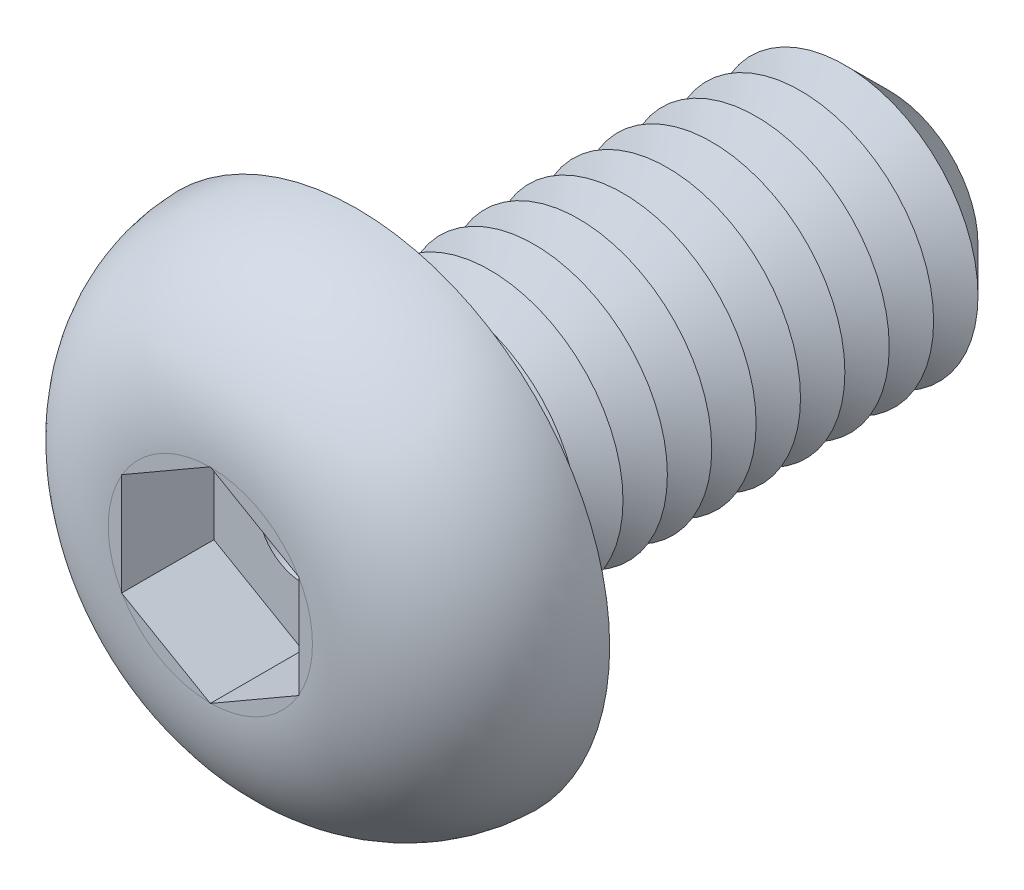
from build123d import *

# Parameters (mm, degrees)
CUT_EXTRUDE1_DEPTH  = 1.04
SKETCH4_R           = 1.5
BOSS_EXTRUDE1_DEPTH = 6
CHAMFER1_SIZE       = 0.5
LPATTERN1_COUNT     = 10
LPATTERN1_PITCH     = 0.5
FILLET2_R           = 0.25
SKETCH6_R           = 0.5
CUT_EXTRUDE2_DEPTH  = 6.61


with BuildPart() as part:
    # Sketch2 → Revolve1 (revolve)
    with BuildSketch(Plane(origin=(0, 0, 0), x_dir=(0, 0, -1), z_dir=(1, 0, 0)), mode=Mode.PRIVATE) as revolve1_sk:
        with BuildLine():
            Line((0, 0), (-1.65, 0))
            Line((-1.65, 0), (-1.65, 1.150735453))
            ThreePointArc((-1.65, 1.150735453), (-1.169631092, 2.335007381), (0, 2.85))
            Line((0, 2.85), (0, 0))
        make_face()
    revolve(revolve1_sk.sketch.rotate(Axis((0, 0, 47.934239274), (0, 0, -1)), 90), axis=Axis((0, 0, 47.934239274), (0, 0, -1)))

    # Sketch3 → Cut-Extrude1 (cut)
    with BuildSketch(Plane.XY.offset(1.65)):
        Polygon((0, 1.154700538), (-1, 0.577350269), (-1, -0.577350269), (0, -1.154700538), (1, -0.577350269), (1, 0.577350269), align=None)
    extrude(amount=-CUT_EXTRUDE1_DEPTH, mode=Mode.SUBTRACT)


with BuildPart() as cut_extrude1_kept_piece:
    # of the separate pieces the step leaves, the one the design keeps (cut_extrude1_pieces_kept)
    add(part.part.solids().sort_by_distance((2.85, 0, 0))[0])

    # Sketch4 → Boss-Extrude1 (add)
    with BuildSketch(Plane(origin=(0, 0, 0), x_dir=(-1, 0, 0), z_dir=(0, 0, -1))):
        with Locations(Location((0, 0, 0), (0, 0, 180))):
            Circle(SKETCH4_R)
    extrude(amount=BOSS_EXTRUDE1_DEPTH)

    # Chamfer1
    chamfer1_edges = [cut_extrude1_kept_piece.edges().sort_by_distance(p)[0] for p in [
        (-1.5, 0, -6),
    ]]
    chamfer(chamfer1_edges, length=CHAMFER1_SIZE)

    # Sketch5 → Cut-Revolve1 (revolve, cut)
    with BuildSketch(Plane(origin=(0, 0, 0), x_dir=(0, 0, -1), z_dir=(1, 0, 0)), mode=Mode.PRIVATE) as cut_revolve1_sk:
        Polygon((0.5, 1.5), (1, 1.5), (0.75, 1.066987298), align=None)
    cut_revolve1 = revolve(cut_revolve1_sk.sketch.rotate(Axis((0, 0, 47.934239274), (0, 0, -1)), 90), axis=Axis((0, 0, 47.934239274), (0, 0, -1)), mode=Mode.SUBTRACT)

    # LPattern1: Cut-Revolve1 ×10
    with Locations(*[(0, 0, -i * LPATTERN1_PITCH) for i in range(1, LPATTERN1_COUNT)]):
        add(cut_revolve1, mode=Mode.SUBTRACT)

    # Fillet2
    fillet2_edges = [cut_extrude1_kept_piece.edges().sort_by_distance(p)[0] for p in [
        (-1.5, 0, 0),
    ]]
    fillet(fillet2_edges, radius=FILLET2_R)

    # Sketch6 → Cut-Extrude2 (cut)
    with BuildSketch(Plane.XY.offset(0.61)):
        Circle(SKETCH6_R)
    extrude(amount=-CUT_EXTRUDE2_DEPTH, mode=Mode.SUBTRACT)


solid = cut_extrude1_kept_piece.part
